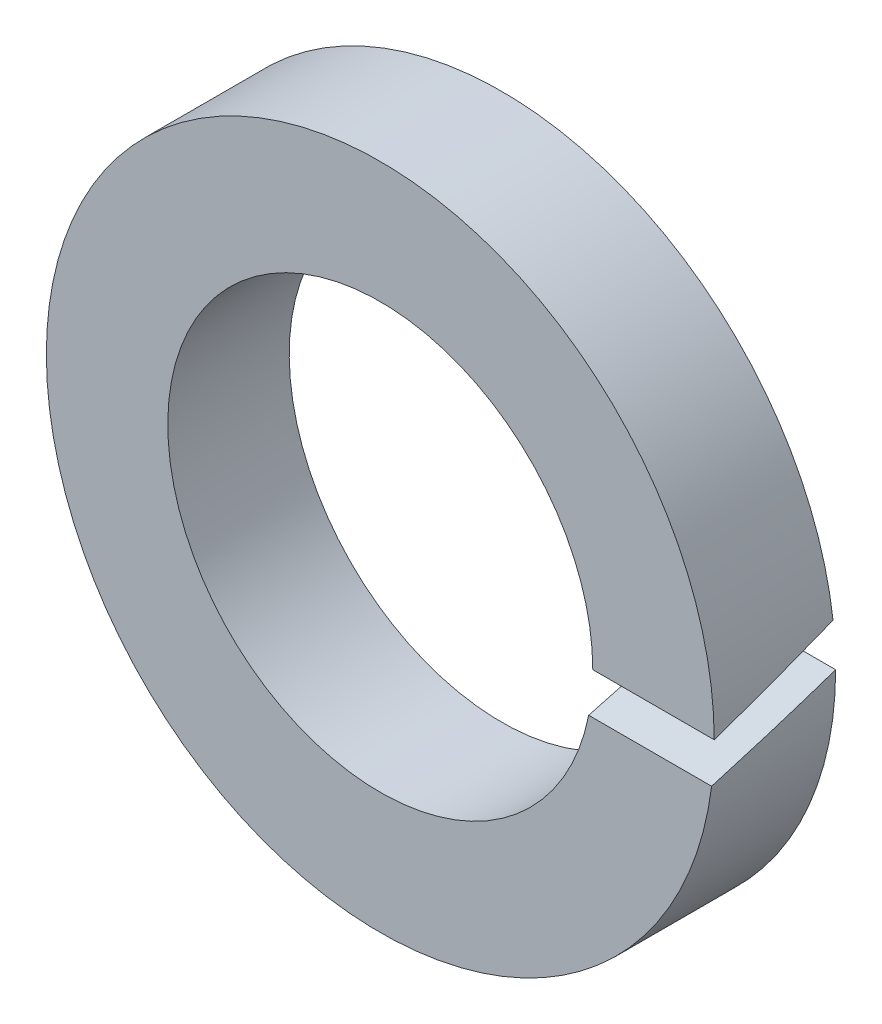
from build123d import *

# Parameters (mm, degrees)
SKETCH1_R          = 8.25
BASE_EXTRUDE_DEPTH = 3
SKETCH2_R          = 5.25
CUT_EXTRUDE1_DEPTH = 13.046783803
CUT_EXTRUDE2_DEPTH = 13.046783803


with BuildPart() as part:
    # Sketch1 → Base-Extrude (new body)
    with BuildSketch(Plane.XY):
        Circle(SKETCH1_R)
    extrude(amount=BASE_EXTRUDE_DEPTH)

    # Sketch2 → Cut-Extrude1 (cut, through all)
    with BuildSketch(Plane.XY.offset(3)):
        Circle(SKETCH2_R)
    extrude(amount=-CUT_EXTRUDE1_DEPTH, mode=Mode.SUBTRACT)

    # Sketch3 → Cut-Extrude2 (cut, through all)
    with BuildSketch(Plane(origin=(0, 0, 0), x_dir=(0, 0, -1), z_dir=(1, 0, 0))):
        Polygon((0, 1.025755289), (-3, 0), (-3, -1.025755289), (0, 0), align=None)
    extrude(amount=CUT_EXTRUDE2_DEPTH, mode=Mode.SUBTRACT)


solid = part.part
